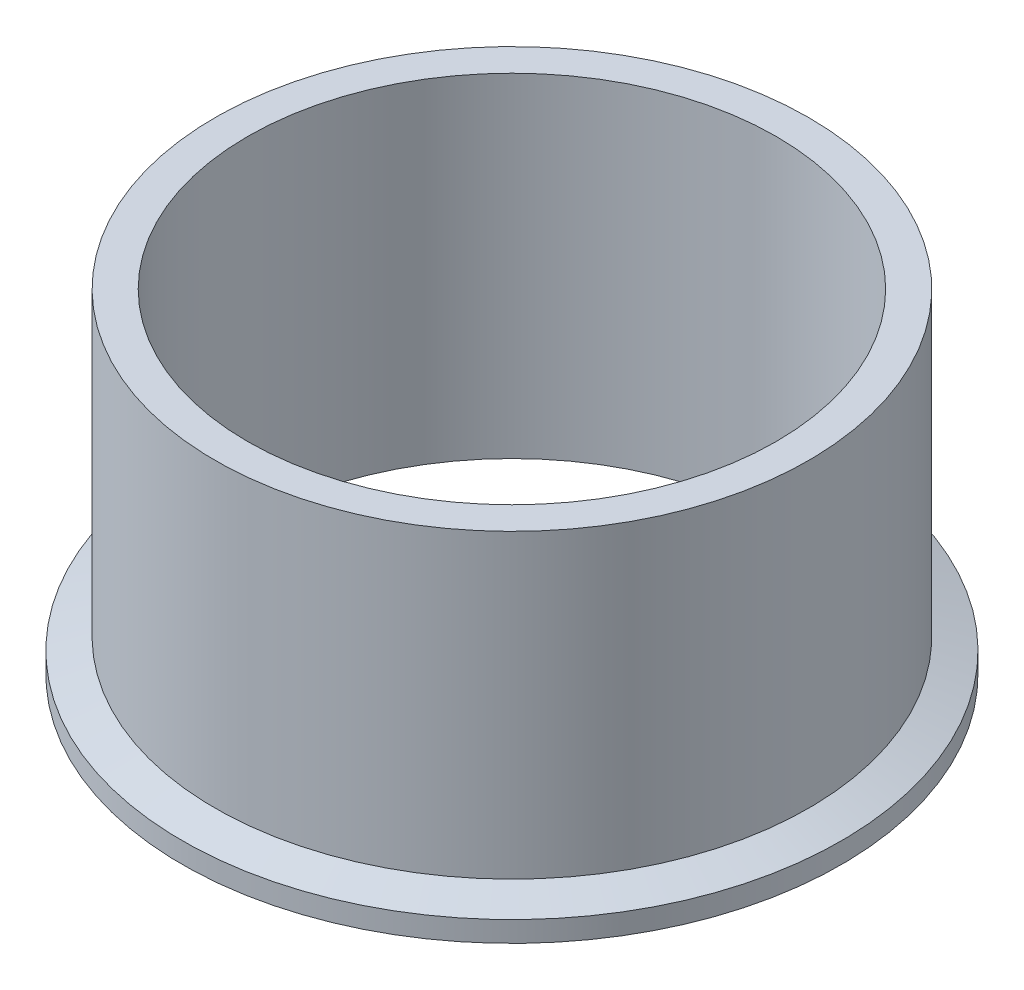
ISO-10303-21;
HEADER;
FILE_DESCRIPTION(('STEP AP214'),'2;1');
FILE_NAME('part.step','',(''),(''),'','','');
FILE_SCHEMA(('AUTOMOTIVE_DESIGN { 1 0 10303 214 1 1 1 1 }'));
ENDSEC;
DATA;
#1=APPLICATION_CONTEXT('core data for automotive mechanical design processes');
#2=APPLICATION_PROTOCOL_DEFINITION('international standard','automotive_design',2000,#1);
#3=PRODUCT_CONTEXT('',#1,'mechanical');
#4=PRODUCT('Part','Part','',(#3));
#5=PRODUCT_RELATED_PRODUCT_CATEGORY('part','',(#4));
#6=PRODUCT_DEFINITION_FORMATION('','',#4);
#7=PRODUCT_DEFINITION_CONTEXT('part definition',#1,'design');
#8=PRODUCT_DEFINITION('design','',#6,#7);
#9=PRODUCT_DEFINITION_SHAPE('','',#8);
#10=(LENGTH_UNIT() NAMED_UNIT(*) SI_UNIT(.MILLI.,.METRE.));
#11=(NAMED_UNIT(*) PLANE_ANGLE_UNIT() SI_UNIT($,.RADIAN.));
#12=(NAMED_UNIT(*) SI_UNIT($,.STERADIAN.) SOLID_ANGLE_UNIT());
#13=UNCERTAINTY_MEASURE_WITH_UNIT(LENGTH_MEASURE(1.E-05),#10,'distance_accuracy_value','');
#14=(GEOMETRIC_REPRESENTATION_CONTEXT(3) GLOBAL_UNCERTAINTY_ASSIGNED_CONTEXT((#13)) GLOBAL_UNIT_ASSIGNED_CONTEXT((#10,
#11,#12)) REPRESENTATION_CONTEXT('',''));
#15=CARTESIAN_POINT('',(0.,0.,0.));
#16=DIRECTION('',(0.,0.,1.));
#17=DIRECTION('',(1.,0.,0.));
#18=AXIS2_PLACEMENT_3D('',#15,#16,#17);
#19=CARTESIAN_POINT('',(0.,0.7874,0.));
#20=DIRECTION('',(0.,-1.,0.));
#21=DIRECTION('',(0.,0.,-1.));
#22=AXIS2_PLACEMENT_3D('',#19,#20,#21);
#23=TOROIDAL_SURFACE('',#22,43.4867084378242,0.787400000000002);
#24=CARTESIAN_POINT('',(0.,0.,0.));
#25=DIRECTION('',(0.,-1.,0.));
#26=DIRECTION('',(0.,0.,-1.));
#27=AXIS2_PLACEMENT_3D('',#24,#25,#26);
#28=CIRCLE('',#27,43.4867084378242);
#29=CARTESIAN_POINT('',(0.,0.,-43.4867084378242));
#30=VERTEX_POINT('',#29);
#31=EDGE_CURVE('E67',#30,#30,#28,.T.);
#32=ORIENTED_EDGE('',*,*,#31,.T.);
#33=EDGE_LOOP('',(#32));
#34=FACE_BOUND('',#33,.T.);
#35=CARTESIAN_POINT('',(0.,0.474458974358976,0.));
#36=DIRECTION('',(0.,-1.,0.));
#37=DIRECTION('',(0.,0.,-1.));
#38=AXIS2_PLACEMENT_3D('',#35,#36,#37);
#39=CIRCLE('',#38,42.7641666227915);
#40=CARTESIAN_POINT('',(0.,0.474458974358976,-42.7641666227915));
#41=VERTEX_POINT('',#40);
#42=EDGE_CURVE('E10',#41,#41,#39,.T.);
#43=ORIENTED_EDGE('',*,*,#42,.F.);
#44=EDGE_LOOP('',(#43));
#45=FACE_BOUND('',#44,.T.);
#46=ADVANCED_FACE('F33',(#34,#45),#23,.T.);
#47=CARTESIAN_POINT('',(0.,0.,0.));
#48=DIRECTION('',(0.,-1.,0.));
#49=DIRECTION('',(0.,0.,-1.));
#50=AXIS2_PLACEMENT_3D('',#47,#48,#49);
#51=TOROIDAL_SURFACE('',#50,41.6687,1.1938);
#52=CARTESIAN_POINT('',(0.,0.474458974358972,0.));
#53=DIRECTION('',(0.,-1.,0.));
#54=DIRECTION('',(0.,0.,-1.));
#55=AXIS2_PLACEMENT_3D('',#52,#53,#54);
#56=CIRCLE('',#55,40.5732333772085);
#57=CARTESIAN_POINT('',(0.,0.474458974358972,-40.5732333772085));
#58=VERTEX_POINT('',#57);
#59=EDGE_CURVE('E39',#58,#58,#56,.T.);
#60=ORIENTED_EDGE('',*,*,#59,.F.);
#61=EDGE_LOOP('',(#60));
#62=FACE_BOUND('',#61,.T.);
#63=ORIENTED_EDGE('',*,*,#42,.T.);
#64=EDGE_LOOP('',(#63));
#65=FACE_BOUND('',#64,.T.);
#66=ADVANCED_FACE('F115',(#62,#65),#51,.F.);
#67=CARTESIAN_POINT('',(0.,0.7874,0.));
#68=DIRECTION('',(0.,-1.,0.));
#69=DIRECTION('',(0.,0.,-1.));
#70=AXIS2_PLACEMENT_3D('',#67,#68,#69);
#71=TOROIDAL_SURFACE('',#70,39.8506915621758,0.787399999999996);
#72=ORIENTED_EDGE('',*,*,#59,.T.);
#73=EDGE_LOOP('',(#72));
#74=FACE_BOUND('',#73,.T.);
#75=CARTESIAN_POINT('',(0.,0.,0.));
#76=DIRECTION('',(0.,-1.,0.));
#77=DIRECTION('',(0.,0.,-1.));
#78=AXIS2_PLACEMENT_3D('',#75,#76,#77);
#79=CIRCLE('',#78,39.8506915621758);
#80=CARTESIAN_POINT('',(0.,0.,-39.8506915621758));
#81=VERTEX_POINT('',#80);
#82=EDGE_CURVE('E43',#81,#81,#79,.T.);
#83=ORIENTED_EDGE('',*,*,#82,.F.);
#84=EDGE_LOOP('',(#83));
#85=FACE_BOUND('',#84,.T.);
#86=ADVANCED_FACE('F111',(#74,#85),#71,.T.);
#87=CARTESIAN_POINT('',(0.,0.,0.));
#88=DIRECTION('',(0.,1.,0.));
#89=DIRECTION('',(0.,0.,1.));
#90=AXIS2_PLACEMENT_3D('',#87,#88,#89);
#91=PLANE('',#90);
#92=CARTESIAN_POINT('',(0.,0.,0.));
#93=DIRECTION('',(0.,-1.,0.));
#94=DIRECTION('',(0.,0.,-1.));
#95=AXIS2_PLACEMENT_3D('',#92,#93,#94);
#96=CIRCLE('',#95,36.449);
#97=CARTESIAN_POINT('',(0.,0.,-36.449));
#98=VERTEX_POINT('',#97);
#99=EDGE_CURVE('E47',#98,#98,#96,.T.);
#100=ORIENTED_EDGE('',*,*,#99,.F.);
#101=EDGE_LOOP('',(#100));
#102=FACE_BOUND('',#101,.T.);
#103=ORIENTED_EDGE('',*,*,#82,.T.);
#104=EDGE_LOOP('',(#103));
#105=FACE_BOUND('',#104,.T.);
#106=ADVANCED_FACE('F105',(#102,#105),#91,.F.);
#107=CARTESIAN_POINT('',(0.,0.,0.));
#108=DIRECTION('',(0.,-1.,0.));
#109=DIRECTION('',(0.,0.,-1.));
#110=AXIS2_PLACEMENT_3D('',#107,#108,#109);
#111=CYLINDRICAL_SURFACE('',#110,36.449);
#112=ORIENTED_EDGE('',*,*,#99,.T.);
#113=EDGE_LOOP('',(#112));
#114=FACE_BOUND('',#113,.T.);
#115=CARTESIAN_POINT('',(0.,46.0248,0.));
#116=DIRECTION('',(0.,-1.,0.));
#117=DIRECTION('',(0.,0.,-1.));
#118=AXIS2_PLACEMENT_3D('',#115,#116,#117);
#119=CIRCLE('',#118,36.449);
#120=CARTESIAN_POINT('',(0.,46.0248,-36.449));
#121=VERTEX_POINT('',#120);
#122=EDGE_CURVE('E52',#121,#121,#119,.T.);
#123=ORIENTED_EDGE('',*,*,#122,.F.);
#124=EDGE_LOOP('',(#123));
#125=FACE_BOUND('',#124,.T.);
#126=ADVANCED_FACE('F100',(#114,#125),#111,.F.);
#127=CARTESIAN_POINT('',(0.,46.0248,0.));
#128=DIRECTION('',(0.,-1.,0.));
#129=DIRECTION('',(0.,0.,-1.));
#130=AXIS2_PLACEMENT_3D('',#127,#128,#129);
#131=PLANE('',#130);
#132=CARTESIAN_POINT('',(0.,46.0248,0.));
#133=DIRECTION('',(0.,-1.,0.));
#134=DIRECTION('',(0.,0.,-1.));
#135=AXIS2_PLACEMENT_3D('',#132,#133,#134);
#136=CIRCLE('',#135,40.9448);
#137=CARTESIAN_POINT('',(0.,46.0248,-40.9448));
#138=VERTEX_POINT('',#137);
#139=EDGE_CURVE('E55',#138,#138,#136,.T.);
#140=ORIENTED_EDGE('',*,*,#139,.F.);
#141=EDGE_LOOP('',(#140));
#142=FACE_BOUND('',#141,.T.);
#143=ORIENTED_EDGE('',*,*,#122,.T.);
#144=EDGE_LOOP('',(#143));
#145=FACE_BOUND('',#144,.T.);
#146=ADVANCED_FACE('F94',(#142,#145),#131,.F.);
#147=CARTESIAN_POINT('',(0.,0.,0.));
#148=DIRECTION('',(0.,-1.,0.));
#149=DIRECTION('',(0.,0.,-1.));
#150=AXIS2_PLACEMENT_3D('',#147,#148,#149);
#151=CYLINDRICAL_SURFACE('',#150,40.9448);
#152=CARTESIAN_POINT('',(0.,4.48575980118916,0.));
#153=DIRECTION('',(0.,-1.,0.));
#154=DIRECTION('',(0.,0.,-1.));
#155=AXIS2_PLACEMENT_3D('',#152,#153,#154);
#156=CIRCLE('',#155,40.9448);
#157=CARTESIAN_POINT('',(0.,4.48575980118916,-40.9448));
#158=VERTEX_POINT('',#157);
#159=EDGE_CURVE('E58',#158,#158,#156,.T.);
#160=ORIENTED_EDGE('',*,*,#159,.F.);
#161=EDGE_LOOP('',(#160));
#162=FACE_BOUND('',#161,.T.);
#163=ORIENTED_EDGE('',*,*,#139,.T.);
#164=EDGE_LOOP('',(#163));
#165=FACE_BOUND('',#164,.T.);
#166=ADVANCED_FACE('F88',(#162,#165),#151,.T.);
#167=CARTESIAN_POINT('',(0.,4.48575980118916,0.));
#168=DIRECTION('',(0.,-1.,0.));
#169=DIRECTION('',(0.,0.,-1.));
#170=AXIS2_PLACEMENT_3D('',#167,#168,#169);
#171=CONICAL_SURFACE('',#170,40.9448,1.22173047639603);
#172=CARTESIAN_POINT('',(0.,2.8448,0.));
#173=DIRECTION('',(0.,-1.,0.));
#174=DIRECTION('',(0.,0.,-1.));
#175=AXIS2_PLACEMENT_3D('',#172,#173,#174);
#176=CIRCLE('',#175,45.4533);
#177=CARTESIAN_POINT('',(0.,2.8448,-45.4533));
#178=VERTEX_POINT('',#177);
#179=EDGE_CURVE('E61',#178,#178,#176,.T.);
#180=ORIENTED_EDGE('',*,*,#179,.F.);
#181=EDGE_LOOP('',(#180));
#182=FACE_BOUND('',#181,.T.);
#183=ORIENTED_EDGE('',*,*,#159,.T.);
#184=EDGE_LOOP('',(#183));
#185=FACE_BOUND('',#184,.T.);
#186=ADVANCED_FACE('F82',(#182,#185),#171,.T.);
#187=CARTESIAN_POINT('',(0.,0.,0.));
#188=DIRECTION('',(0.,-1.,0.));
#189=DIRECTION('',(0.,0.,-1.));
#190=AXIS2_PLACEMENT_3D('',#187,#188,#189);
#191=CYLINDRICAL_SURFACE('',#190,45.4533);
#192=CARTESIAN_POINT('',(0.,0.,0.));
#193=DIRECTION('',(0.,-1.,0.));
#194=DIRECTION('',(0.,0.,-1.));
#195=AXIS2_PLACEMENT_3D('',#192,#193,#194);
#196=CIRCLE('',#195,45.4533);
#197=CARTESIAN_POINT('',(0.,0.,-45.4533));
#198=VERTEX_POINT('',#197);
#199=EDGE_CURVE('E64',#198,#198,#196,.T.);
#200=ORIENTED_EDGE('',*,*,#199,.F.);
#201=EDGE_LOOP('',(#200));
#202=FACE_BOUND('',#201,.T.);
#203=ORIENTED_EDGE('',*,*,#179,.T.);
#204=EDGE_LOOP('',(#203));
#205=FACE_BOUND('',#204,.T.);
#206=ADVANCED_FACE('F76',(#202,#205),#191,.T.);
#207=CARTESIAN_POINT('',(0.,0.,0.));
#208=DIRECTION('',(0.,1.,0.));
#209=DIRECTION('',(0.,0.,1.));
#210=AXIS2_PLACEMENT_3D('',#207,#208,#209);
#211=PLANE('',#210);
#212=ORIENTED_EDGE('',*,*,#31,.F.);
#213=EDGE_LOOP('',(#212));
#214=FACE_BOUND('',#213,.T.);
#215=ORIENTED_EDGE('',*,*,#199,.T.);
#216=EDGE_LOOP('',(#215));
#217=FACE_BOUND('',#216,.T.);
#218=ADVANCED_FACE('F73',(#214,#217),#211,.F.);
#219=CLOSED_SHELL('',(#46,#66,#86,#106,#126,#146,#166,#186,#206,#218));
#220=MANIFOLD_SOLID_BREP('B2',#219);
#221=ADVANCED_BREP_SHAPE_REPRESENTATION('',(#18,#220),#14);
#222=SHAPE_DEFINITION_REPRESENTATION(#9,#221);
ENDSEC;
END-ISO-10303-21;
